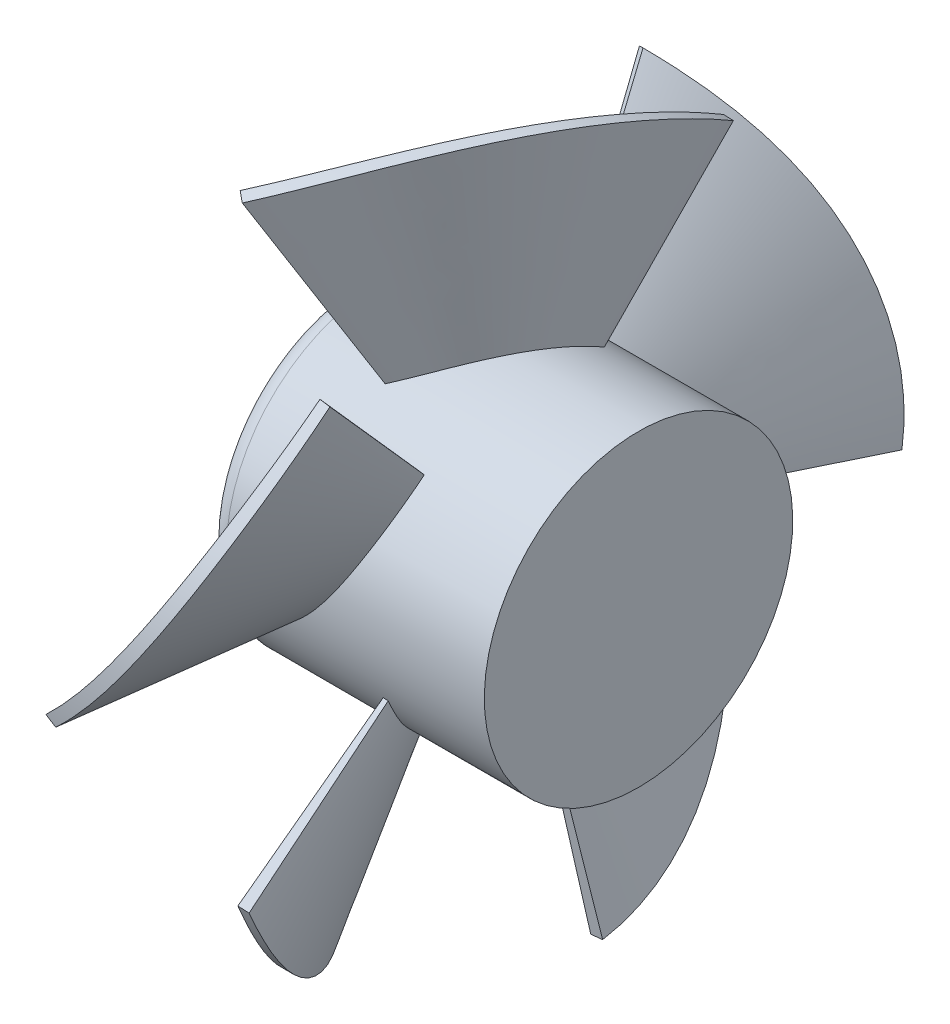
from build123d import *

# Parameters (mm, degrees)
SKETCH5_W                  = 22.4
SKETCH5_H                  = 12.5
CIRPATTERN1_COUNT          = 5
SKETCH_CUT_BLADE_OUTSIDE_W = 82.432
SKETCH_CUT_BLADE_OUTSIDE_H = 79.929
SKETCH_CUT_BLADE_OUTSIDE_R = 28
CUT_FAN_BLADE_DEPTH        = 52.639384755
COSMETIC_FILLET_R          = 1.5


with BuildPart() as part:
    # Sketch5 → Body (revolve)
    with BuildSketch(Plane.XY, mode=Mode.PRIVATE) as body_sk:
        with Locations((-14.2, 6.25)):
            Rectangle(SKETCH5_W, SKETCH5_H)
    revolve(body_sk.sketch.rotate(Axis((-25.4, 0, 0), (1, 0, 0)), 180), axis=Axis((-25.4, 0, 0), (1, 0, 0)))

    # Sketch-Blade-Top → Loft-Fan-Blade section 0
    with BuildSketch(Plane(origin=(0, 28, 0), x_dir=(-1, 0, 0), z_dir=(0, 1, 0)), mode=Mode.PRIVATE) as loft_fan_blade_s0:
        with BuildLine():
            Line((24.234930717, 13.316802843), (23.552932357, 14.048156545))
            ThreePointArc((23.552932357, 14.048156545), (13.308993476, 0.4539905), (8.332318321, -15.823980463))
            Line((8.332318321, -15.823980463), (9.324864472, -15.945849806))
            ThreePointArc((9.324864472, -15.945849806), (14.2, 0), (24.234930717, 13.316802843))
        make_face()
    loft_fan_blade = loft([loft_fan_blade_s0.sketch, Vertex(-14.2, 0, 0)])

    # CirPattern1: Loft-Fan-Blade ×5 about axis
    cirpattern1_axis = Axis((-25.4, 0, 0), (1, 0, 0))
    for i in range(1, CIRPATTERN1_COUNT):
        add(loft_fan_blade.rotate(cirpattern1_axis, i * 360 / CIRPATTERN1_COUNT))

    # Sketch-Cut-Blade outside → Cut-Fan-Blade (cut, through all)
    with BuildSketch(Plane(origin=(0, 0, 0), x_dir=(0, 0, -1), z_dir=(1, 0, 0))):
        with Locations((0.293, -2.0125)):
            Rectangle(SKETCH_CUT_BLADE_OUTSIDE_W, SKETCH_CUT_BLADE_OUTSIDE_H)
        Circle(SKETCH_CUT_BLADE_OUTSIDE_R, mode=Mode.SUBTRACT)
    extrude(amount=-CUT_FAN_BLADE_DEPTH, mode=Mode.SUBTRACT)

    # Cosmetic-Fillet
    cosmetic_fillet_edges = [part.edges().sort_by_distance(p)[0] for p in [
        (-25.4, 12.5, 0),
    ]]
    fillet(cosmetic_fillet_edges, radius=COSMETIC_FILLET_R)


solid = part.part
